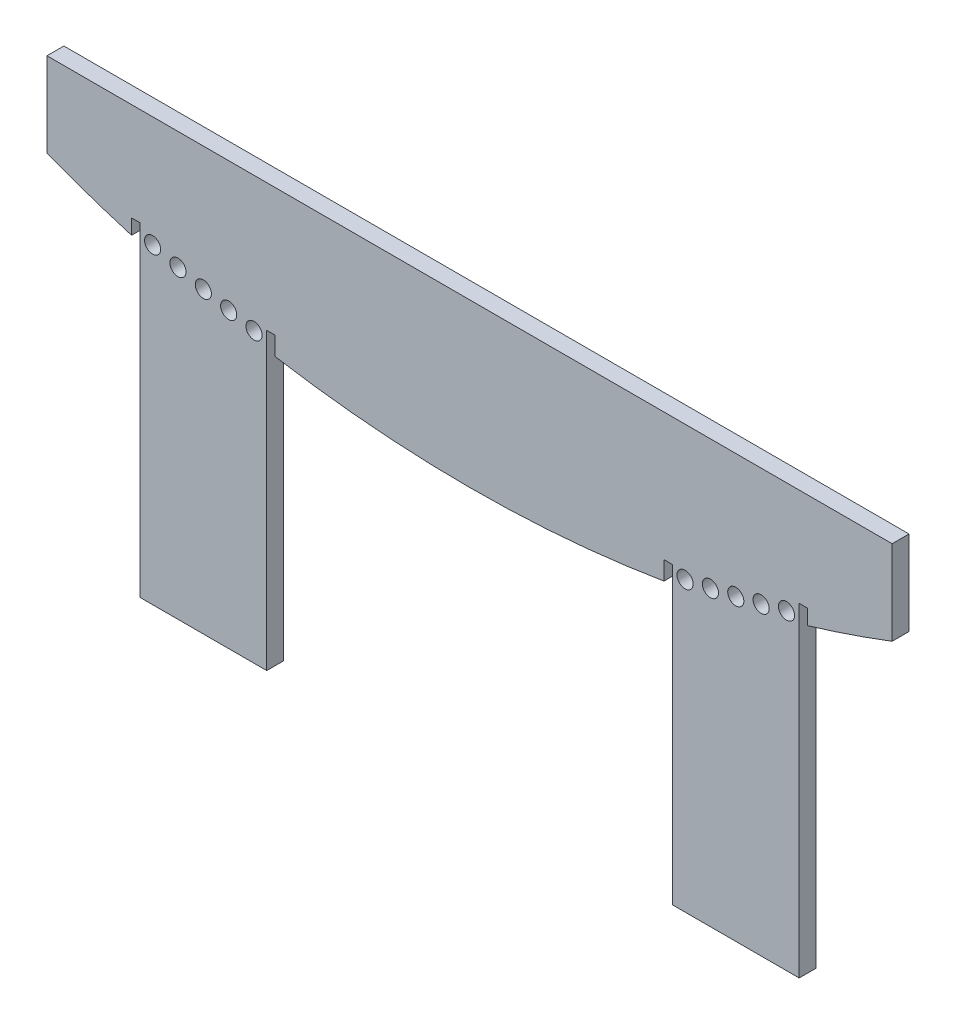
from build123d import *

# Parameters (mm, degrees)
LINEAR_AUSTRAGEN1_DEPTH         = 2
LINEAR_AUSTRAGEN2_DEPTH         = 2
AUSNEHMUNG_R                    = 0.954144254
AUSNEHMUNG_W                    = 1
AUSNEHMUNG_H                    = 38.392499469
AUSNEHMUNG_H_2                  = 34.869948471
SCHNITT_LINEAR_AUSTRAGEN2_DEPTH = 2


with BuildPart() as part:
    # Hauptteil → Linear austragen1 (new body)
    with BuildSketch(Plane.XY):
        with BuildLine():
            Line((50, 0), (-50, 0))
            Line((-50, 0), (-50, -10))
            ThreePointArc((-50, -10), (0, -19.233031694), (50, -10))
            Line((50, -10), (50, 0))
        make_face()
    extrude(amount=LINEAR_AUSTRAGEN1_DEPTH)

    # Skizze2 → Linear austragen2 (add)
    with BuildSketch(Plane.XY):
        with BuildLine():
            Line((-39, -50), (-24, -50))
            Line((-24, -50), (-24, -15.130051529))
            ThreePointArc((-24, -15.130051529), (-31.549201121, -13.578288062), (-39, -11.607500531))
            Line((-39, -11.607500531), (-39, -50))
        make_face()
        with BuildLine():
            Line((24, -15.130051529), (24, -50))
            Line((24, -50), (39, -50))
            Line((39, -50), (39, -11.607500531))
            ThreePointArc((39, -11.607500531), (31.549201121, -13.578288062), (24, -15.130051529))
        make_face()
    extrude(amount=LINEAR_AUSTRAGEN2_DEPTH)

    # Ausnehmung → Schnitt-Linear austragen2 (cut)
    with BuildSketch(Plane.XY):
        with Locations((-37.5, -13.126646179)):
            Circle(AUSNEHMUNG_R)
        with Locations((-25.5, -15.920631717)):
            Circle(AUSNEHMUNG_R)
        with Locations((-34.5, -13.930841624)):
            Circle(AUSNEHMUNG_R)
        with Locations((-31.5, -14.663825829)):
            Circle(AUSNEHMUNG_R)
        with Locations((-28.5, -15.326749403)):
            Circle(AUSNEHMUNG_R)
        with Locations(Location((28.5, -15.326749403, 0), (0, 0, 180))):
            Circle(AUSNEHMUNG_R)
        with Locations(Location((31.5, -14.663825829, 0), (0, 0, 180))):
            Circle(AUSNEHMUNG_R)
        with Locations(Location((34.5, -13.930841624, 0), (0, 0, 180))):
            Circle(AUSNEHMUNG_R)
        with Locations(Location((25.5, -15.920631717, 0), (0, 0, 180))):
            Circle(AUSNEHMUNG_R)
        with Locations(Location((37.5, -13.126646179, 0), (0, 0, 180))):
            Circle(AUSNEHMUNG_R)
        with Locations((-39.5, -30.803750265)):
            Rectangle(AUSNEHMUNG_W, AUSNEHMUNG_H)
        with Locations((-23.5, -32.565025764)):
            Rectangle(AUSNEHMUNG_W, AUSNEHMUNG_H_2)
        with Locations((23.5, -32.565025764)):
            Rectangle(AUSNEHMUNG_W, AUSNEHMUNG_H_2)
        with Locations((39.5, -30.803750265)):
            Rectangle(AUSNEHMUNG_W, AUSNEHMUNG_H)
    extrude(amount=SCHNITT_LINEAR_AUSTRAGEN2_DEPTH, mode=Mode.SUBTRACT)


solid = part.part
